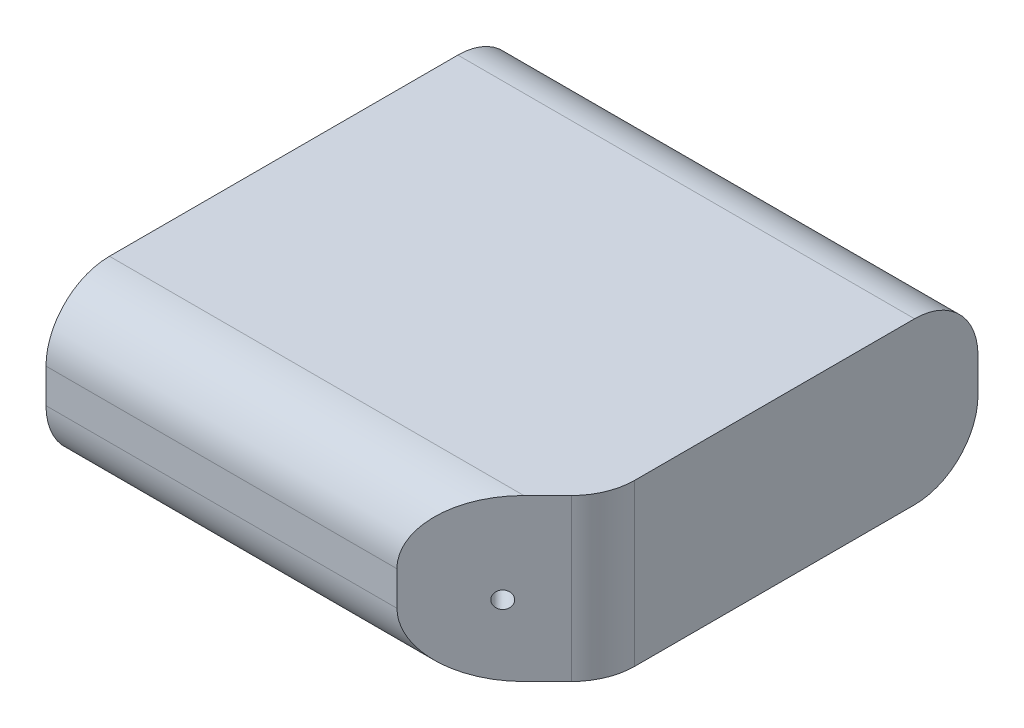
from build123d import *

# Parameters (mm, degrees)
SKETCH2_W          = 224.8
SKETCH2_H          = 76.2
EXTRUDE1_DEPTH     = 216
CHAMFER1_SIZE      = 50
SKETCH3_R          = 4
CUT_EXTRUDE1_DEPTH = 20
FILLET1_R          = 30


with BuildPart() as part:
    # Sketch2 → Extrude1 (new body)
    with BuildSketch(Plane(origin=(0, 0, 0), x_dir=(0, 0, -1), z_dir=(1, 0, 0))):
        with Locations((112.4, 38.1)):
            Rectangle(SKETCH2_W, SKETCH2_H)
    extrude(amount=-EXTRUDE1_DEPTH)

    # Chamfer1
    chamfer1_edges = [part.edges().sort_by_distance(p)[0] for p in [
        (0, 38.1, 0),
    ]]
    chamfer(chamfer1_edges, length=CHAMFER1_SIZE)

    # Sketch3 → Cut-Extrude1 (cut)
    with BuildSketch(Plane(origin=(-85.355339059, 0, 35.355339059), x_dir=(0.7071067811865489, 0, -0.7071067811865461), z_dir=(0.7071067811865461, 0, 0.7071067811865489))):
        with Locations((85.355339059, 33.498762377)):
            Circle(SKETCH3_R)
    extrude(amount=-CUT_EXTRUDE1_DEPTH, mode=Mode.SUBTRACT)

    # Fillet1
    fillet1_edges = [part.edges().sort_by_distance(p)[0] for p in [
        (0, 38.1, -50),
        (-133, 76.2, 0),
        (-108, 76.2, -224.8),
        (-108, 0, -224.8),
        (-133, 0, 0),
    ]]
    fillet(fillet1_edges, radius=FILLET1_R)


solid = part.part
